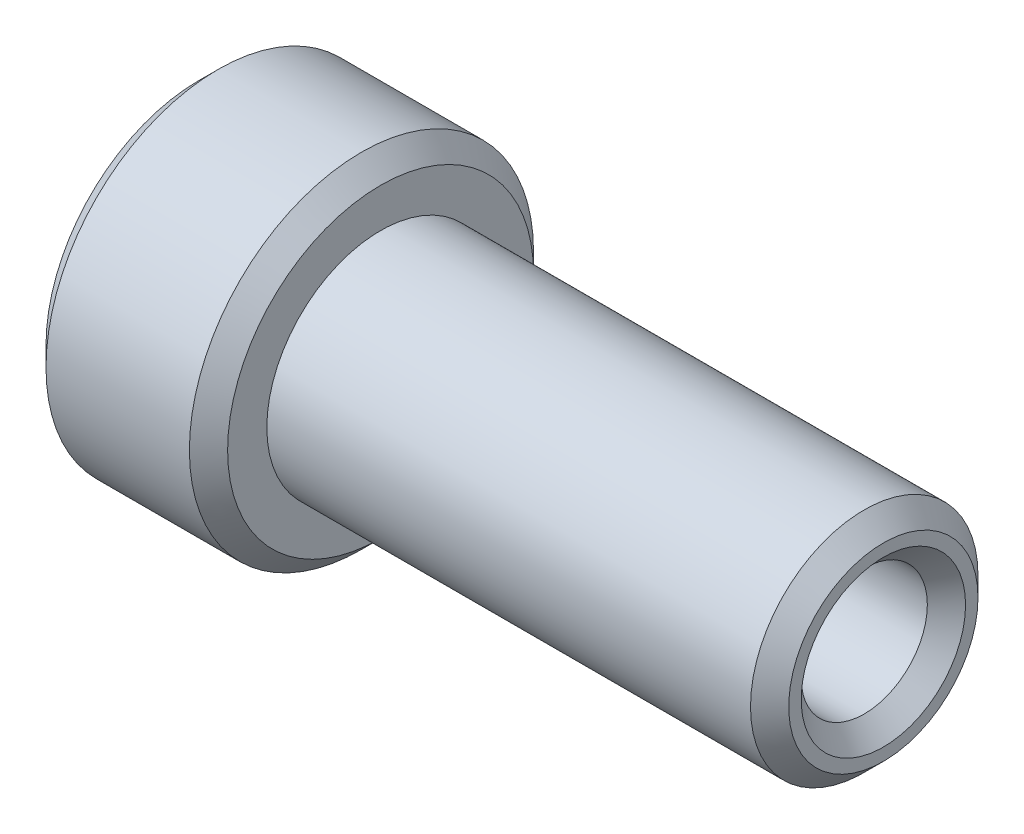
ISO-10303-21;
HEADER;
FILE_DESCRIPTION(('STEP AP214'),'2;1');
FILE_NAME('part.step','',(''),(''),'','','');
FILE_SCHEMA(('AUTOMOTIVE_DESIGN { 1 0 10303 214 1 1 1 1 }'));
ENDSEC;
DATA;
#1=APPLICATION_CONTEXT('core data for automotive mechanical design processes');
#2=APPLICATION_PROTOCOL_DEFINITION('international standard','automotive_design',2000,#1);
#3=PRODUCT_CONTEXT('',#1,'mechanical');
#4=PRODUCT('Part','Part','',(#3));
#5=PRODUCT_RELATED_PRODUCT_CATEGORY('part','',(#4));
#6=PRODUCT_DEFINITION_FORMATION('','',#4);
#7=PRODUCT_DEFINITION_CONTEXT('part definition',#1,'design');
#8=PRODUCT_DEFINITION('design','',#6,#7);
#9=PRODUCT_DEFINITION_SHAPE('','',#8);
#10=(LENGTH_UNIT() NAMED_UNIT(*) SI_UNIT(.MILLI.,.METRE.));
#11=(NAMED_UNIT(*) PLANE_ANGLE_UNIT() SI_UNIT($,.RADIAN.));
#12=(NAMED_UNIT(*) SI_UNIT($,.STERADIAN.) SOLID_ANGLE_UNIT());
#13=UNCERTAINTY_MEASURE_WITH_UNIT(LENGTH_MEASURE(1.E-05),#10,'distance_accuracy_value','');
#14=(GEOMETRIC_REPRESENTATION_CONTEXT(3) GLOBAL_UNCERTAINTY_ASSIGNED_CONTEXT((#13)) GLOBAL_UNIT_ASSIGNED_CONTEXT((#10,
#11,#12)) REPRESENTATION_CONTEXT('',''));
#15=CARTESIAN_POINT('',(0.,0.,0.));
#16=DIRECTION('',(0.,0.,1.));
#17=DIRECTION('',(1.,0.,0.));
#18=AXIS2_PLACEMENT_3D('',#15,#16,#17);
#19=CARTESIAN_POINT('',(0.,0.,0.));
#20=DIRECTION('',(-1.,0.,0.));
#21=DIRECTION('',(0.,0.,1.));
#22=AXIS2_PLACEMENT_3D('',#19,#20,#21);
#23=PLANE('',#22);
#24=CARTESIAN_POINT('',(0.,0.,0.));
#25=DIRECTION('',(-1.,0.,0.));
#26=DIRECTION('',(0.,0.,1.));
#27=AXIS2_PLACEMENT_3D('',#24,#25,#26);
#28=CIRCLE('',#27,4.);
#29=CARTESIAN_POINT('',(0.,0.,4.));
#30=VERTEX_POINT('',#29);
#31=EDGE_CURVE('E31',#30,#30,#28,.T.);
#32=ORIENTED_EDGE('',*,*,#31,.T.);
#33=EDGE_LOOP('',(#32));
#34=FACE_BOUND('',#33,.T.);
#35=CARTESIAN_POINT('',(0.,0.,0.));
#36=DIRECTION('',(-1.,0.,0.));
#37=DIRECTION('',(0.,0.,1.));
#38=AXIS2_PLACEMENT_3D('',#35,#36,#37);
#39=CIRCLE('',#38,2.15);
#40=CARTESIAN_POINT('',(0.,0.,2.15));
#41=VERTEX_POINT('',#40);
#42=EDGE_CURVE('E36',#41,#41,#39,.F.);
#43=ORIENTED_EDGE('',*,*,#42,.T.);
#44=EDGE_LOOP('',(#43));
#45=FACE_BOUND('',#44,.T.);
#46=ADVANCED_FACE('F16',(#34,#45),#23,.T.);
#47=CARTESIAN_POINT('',(0.,0.,0.));
#48=DIRECTION('',(1.,0.,0.));
#49=DIRECTION('',(0.,0.,-1.));
#50=AXIS2_PLACEMENT_3D('',#47,#48,#49);
#51=CYLINDRICAL_SURFACE('',#50,4.5);
#52=CARTESIAN_POINT('',(0.5,0.,0.));
#53=DIRECTION('',(-1.,0.,0.));
#54=DIRECTION('',(0.,0.,1.));
#55=AXIS2_PLACEMENT_3D('',#52,#53,#54);
#56=CIRCLE('',#55,4.5);
#57=CARTESIAN_POINT('',(0.5,0.,4.5));
#58=VERTEX_POINT('',#57);
#59=EDGE_CURVE('E39',#58,#58,#56,.F.);
#60=ORIENTED_EDGE('',*,*,#59,.T.);
#61=EDGE_LOOP('',(#60));
#62=FACE_BOUND('',#61,.T.);
#63=CARTESIAN_POINT('',(4.25,0.,0.));
#64=DIRECTION('',(1.,0.,0.));
#65=DIRECTION('',(0.,0.,-1.));
#66=AXIS2_PLACEMENT_3D('',#63,#64,#65);
#67=CIRCLE('',#66,4.5);
#68=CARTESIAN_POINT('',(4.25,0.,-4.5));
#69=VERTEX_POINT('',#68);
#70=EDGE_CURVE('E42',#69,#69,#67,.F.);
#71=ORIENTED_EDGE('',*,*,#70,.T.);
#72=EDGE_LOOP('',(#71));
#73=FACE_BOUND('',#72,.T.);
#74=ADVANCED_FACE('F62',(#62,#73),#51,.T.);
#75=CARTESIAN_POINT('',(4.75,4.5,0.));
#76=DIRECTION('',(1.,0.,0.));
#77=DIRECTION('',(0.,0.,-1.));
#78=AXIS2_PLACEMENT_3D('',#75,#76,#77);
#79=PLANE('',#78);
#80=CARTESIAN_POINT('',(4.75,0.,0.));
#81=DIRECTION('',(1.,0.,0.));
#82=DIRECTION('',(0.,0.,-1.));
#83=AXIS2_PLACEMENT_3D('',#80,#81,#82);
#84=CIRCLE('',#83,4.);
#85=CARTESIAN_POINT('',(4.75,0.,-4.));
#86=VERTEX_POINT('',#85);
#87=EDGE_CURVE('E27',#86,#86,#84,.T.);
#88=ORIENTED_EDGE('',*,*,#87,.T.);
#89=EDGE_LOOP('',(#88));
#90=FACE_BOUND('',#89,.T.);
#91=CARTESIAN_POINT('',(4.75,0.,0.));
#92=DIRECTION('',(1.,0.,0.));
#93=DIRECTION('',(0.,0.,-1.));
#94=AXIS2_PLACEMENT_3D('',#91,#92,#93);
#95=CIRCLE('',#94,2.975);
#96=CARTESIAN_POINT('',(4.75,0.,-2.975));
#97=VERTEX_POINT('',#96);
#98=EDGE_CURVE('E54',#97,#97,#95,.T.);
#99=ORIENTED_EDGE('',*,*,#98,.F.);
#100=EDGE_LOOP('',(#99));
#101=FACE_BOUND('',#100,.T.);
#102=ADVANCED_FACE('F60',(#90,#101),#79,.T.);
#103=CARTESIAN_POINT('',(0.,0.,0.));
#104=DIRECTION('',(1.,0.,0.));
#105=DIRECTION('',(0.,0.,-1.));
#106=AXIS2_PLACEMENT_3D('',#103,#104,#105);
#107=CYLINDRICAL_SURFACE('',#106,2.975);
#108=CARTESIAN_POINT('',(17.4,0.,0.));
#109=DIRECTION('',(1.,0.,0.));
#110=DIRECTION('',(0.,0.,-1.));
#111=AXIS2_PLACEMENT_3D('',#108,#109,#110);
#112=CIRCLE('',#111,2.975);
#113=CARTESIAN_POINT('',(17.4,0.,-2.975));
#114=VERTEX_POINT('',#113);
#115=EDGE_CURVE('E45',#114,#114,#112,.F.);
#116=ORIENTED_EDGE('',*,*,#115,.T.);
#117=EDGE_LOOP('',(#116));
#118=FACE_BOUND('',#117,.T.);
#119=ORIENTED_EDGE('',*,*,#98,.T.);
#120=EDGE_LOOP('',(#119));
#121=FACE_BOUND('',#120,.T.);
#122=ADVANCED_FACE('F58',(#118,#121),#107,.T.);
#123=CARTESIAN_POINT('',(17.9,2.975,0.));
#124=DIRECTION('',(1.,0.,0.));
#125=DIRECTION('',(0.,0.,-1.));
#126=AXIS2_PLACEMENT_3D('',#123,#124,#125);
#127=PLANE('',#126);
#128=CARTESIAN_POINT('',(17.9,0.,0.));
#129=DIRECTION('',(1.,0.,0.));
#130=DIRECTION('',(0.,0.,-1.));
#131=AXIS2_PLACEMENT_3D('',#128,#129,#130);
#132=CIRCLE('',#131,2.475);
#133=CARTESIAN_POINT('',(17.9,0.,-2.475));
#134=VERTEX_POINT('',#133);
#135=EDGE_CURVE('E48',#134,#134,#132,.T.);
#136=ORIENTED_EDGE('',*,*,#135,.T.);
#137=EDGE_LOOP('',(#136));
#138=FACE_BOUND('',#137,.T.);
#139=CARTESIAN_POINT('',(17.9,0.,0.));
#140=DIRECTION('',(1.,0.,0.));
#141=DIRECTION('',(0.,0.,-1.));
#142=AXIS2_PLACEMENT_3D('',#139,#140,#141);
#143=CIRCLE('',#142,2.15);
#144=CARTESIAN_POINT('',(17.9,0.,-2.15));
#145=VERTEX_POINT('',#144);
#146=EDGE_CURVE('E51',#145,#145,#143,.F.);
#147=ORIENTED_EDGE('',*,*,#146,.T.);
#148=EDGE_LOOP('',(#147));
#149=FACE_BOUND('',#148,.T.);
#150=ADVANCED_FACE('F71',(#138,#149),#127,.T.);
#151=CARTESIAN_POINT('',(0.,0.,0.));
#152=DIRECTION('',(-1.,0.,0.));
#153=DIRECTION('',(0.,0.,1.));
#154=AXIS2_PLACEMENT_3D('',#151,#152,#153);
#155=CYLINDRICAL_SURFACE('',#154,1.65);
#156=CARTESIAN_POINT('',(17.4,0.,0.));
#157=DIRECTION('',(1.,0.,0.));
#158=DIRECTION('',(0.,0.,-1.));
#159=AXIS2_PLACEMENT_3D('',#156,#157,#158);
#160=CIRCLE('',#159,1.65);
#161=CARTESIAN_POINT('',(17.4,0.,-1.65));
#162=VERTEX_POINT('',#161);
#163=EDGE_CURVE('E10',#162,#162,#160,.T.);
#164=ORIENTED_EDGE('',*,*,#163,.T.);
#165=EDGE_LOOP('',(#164));
#166=FACE_BOUND('',#165,.T.);
#167=CARTESIAN_POINT('',(0.499999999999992,0.,0.));
#168=DIRECTION('',(-1.,0.,0.));
#169=DIRECTION('',(0.,0.,1.));
#170=AXIS2_PLACEMENT_3D('',#167,#168,#169);
#171=CIRCLE('',#170,1.65);
#172=CARTESIAN_POINT('',(0.499999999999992,0.,1.65));
#173=VERTEX_POINT('',#172);
#174=EDGE_CURVE('E23',#173,#173,#171,.T.);
#175=ORIENTED_EDGE('',*,*,#174,.T.);
#176=EDGE_LOOP('',(#175));
#177=FACE_BOUND('',#176,.T.);
#178=ADVANCED_FACE('F88',(#166,#177),#155,.F.);
#179=CARTESIAN_POINT('',(17.9,0.,0.));
#180=DIRECTION('',(-1.,0.,0.));
#181=DIRECTION('',(0.,0.,1.));
#182=AXIS2_PLACEMENT_3D('',#179,#180,#181);
#183=CONICAL_SURFACE('',#182,2.475,0.785398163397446);
#184=ORIENTED_EDGE('',*,*,#115,.F.);
#185=EDGE_LOOP('',(#184));
#186=FACE_BOUND('',#185,.T.);
#187=ORIENTED_EDGE('',*,*,#135,.F.);
#188=EDGE_LOOP('',(#187));
#189=FACE_BOUND('',#188,.T.);
#190=ADVANCED_FACE('F84',(#186,#189),#183,.T.);
#191=CARTESIAN_POINT('',(0.5,0.,0.));
#192=DIRECTION('',(1.,0.,0.));
#193=DIRECTION('',(0.,0.,-1.));
#194=AXIS2_PLACEMENT_3D('',#191,#192,#193);
#195=CONICAL_SURFACE('',#194,4.5,0.78539816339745);
#196=ORIENTED_EDGE('',*,*,#31,.F.);
#197=EDGE_LOOP('',(#196));
#198=FACE_BOUND('',#197,.T.);
#199=ORIENTED_EDGE('',*,*,#59,.F.);
#200=EDGE_LOOP('',(#199));
#201=FACE_BOUND('',#200,.T.);
#202=ADVANCED_FACE('F87',(#198,#201),#195,.T.);
#203=CARTESIAN_POINT('',(4.75,0.,0.));
#204=DIRECTION('',(-1.,0.,0.));
#205=DIRECTION('',(0.,0.,1.));
#206=AXIS2_PLACEMENT_3D('',#203,#204,#205);
#207=CONICAL_SURFACE('',#206,4.,0.785398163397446);
#208=ORIENTED_EDGE('',*,*,#70,.F.);
#209=EDGE_LOOP('',(#208));
#210=FACE_BOUND('',#209,.T.);
#211=ORIENTED_EDGE('',*,*,#87,.F.);
#212=EDGE_LOOP('',(#211));
#213=FACE_BOUND('',#212,.T.);
#214=ADVANCED_FACE('F92',(#210,#213),#207,.T.);
#215=CARTESIAN_POINT('',(17.9,0.,0.));
#216=DIRECTION('',(1.,0.,0.));
#217=DIRECTION('',(0.,0.,-1.));
#218=AXIS2_PLACEMENT_3D('',#215,#216,#217);
#219=CONICAL_SURFACE('',#218,2.15,0.785398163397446);
#220=ORIENTED_EDGE('',*,*,#163,.F.);
#221=EDGE_LOOP('',(#220));
#222=FACE_BOUND('',#221,.T.);
#223=ORIENTED_EDGE('',*,*,#146,.F.);
#224=EDGE_LOOP('',(#223));
#225=FACE_BOUND('',#224,.T.);
#226=ADVANCED_FACE('F95',(#222,#225),#219,.F.);
#227=CARTESIAN_POINT('',(0.499999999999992,0.,0.));
#228=DIRECTION('',(-1.,0.,0.));
#229=DIRECTION('',(0.,0.,1.));
#230=AXIS2_PLACEMENT_3D('',#227,#228,#229);
#231=CONICAL_SURFACE('',#230,1.65,0.785398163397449);
#232=ORIENTED_EDGE('',*,*,#42,.F.);
#233=EDGE_LOOP('',(#232));
#234=FACE_BOUND('',#233,.T.);
#235=ORIENTED_EDGE('',*,*,#174,.F.);
#236=EDGE_LOOP('',(#235));
#237=FACE_BOUND('',#236,.T.);
#238=ADVANCED_FACE('F18',(#234,#237),#231,.F.);
#239=CLOSED_SHELL('',(#46,#74,#102,#122,#150,#178,#190,#202,#214,#226,#238));
#240=MANIFOLD_SOLID_BREP('B1',#239);
#241=ADVANCED_BREP_SHAPE_REPRESENTATION('',(#18,#240),#14);
#242=SHAPE_DEFINITION_REPRESENTATION(#9,#241);
ENDSEC;
END-ISO-10303-21;
